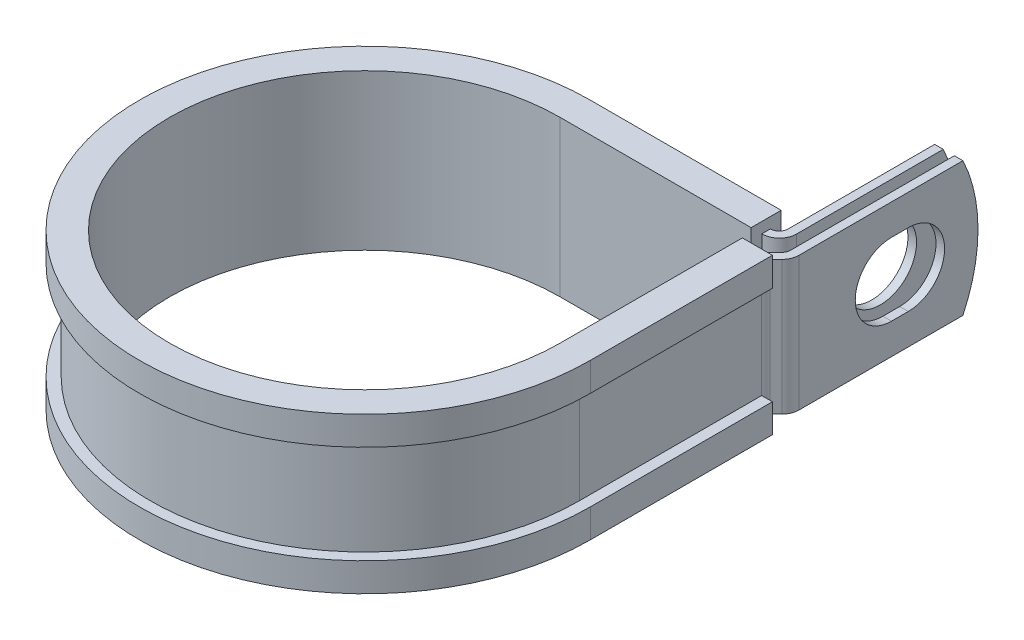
ISO-10303-21;
HEADER;
FILE_DESCRIPTION(('STEP AP214'),'2;1');
FILE_NAME('part.step','',(''),(''),'','','');
FILE_SCHEMA(('AUTOMOTIVE_DESIGN { 1 0 10303 214 1 1 1 1 }'));
ENDSEC;
DATA;
#1=APPLICATION_CONTEXT('core data for automotive mechanical design processes');
#2=APPLICATION_PROTOCOL_DEFINITION('international standard','automotive_design',2000,#1);
#3=PRODUCT_CONTEXT('',#1,'mechanical');
#4=PRODUCT('Part','Part','',(#3));
#5=PRODUCT_RELATED_PRODUCT_CATEGORY('part','',(#4));
#6=PRODUCT_DEFINITION_FORMATION('','',#4);
#7=PRODUCT_DEFINITION_CONTEXT('part definition',#1,'design');
#8=PRODUCT_DEFINITION('design','',#6,#7);
#9=PRODUCT_DEFINITION_SHAPE('','',#8);
#10=(LENGTH_UNIT() NAMED_UNIT(*) SI_UNIT(.MILLI.,.METRE.));
#11=(NAMED_UNIT(*) PLANE_ANGLE_UNIT() SI_UNIT($,.RADIAN.));
#12=(NAMED_UNIT(*) SI_UNIT($,.STERADIAN.) SOLID_ANGLE_UNIT());
#13=UNCERTAINTY_MEASURE_WITH_UNIT(LENGTH_MEASURE(1.E-05),#10,'distance_accuracy_value','');
#14=(GEOMETRIC_REPRESENTATION_CONTEXT(3) GLOBAL_UNCERTAINTY_ASSIGNED_CONTEXT((#13)) GLOBAL_UNIT_ASSIGNED_CONTEXT((#10,
#11,#12)) REPRESENTATION_CONTEXT('',''));
#15=CARTESIAN_POINT('',(0.,0.,0.));
#16=DIRECTION('',(0.,0.,1.));
#17=DIRECTION('',(1.,0.,0.));
#18=AXIS2_PLACEMENT_3D('',#15,#16,#17);
#19=CARTESIAN_POINT('',(29.9771698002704,-9.525,-29.2989));
#20=DIRECTION('',(0.,1.,0.));
#21=DIRECTION('',(1.,0.,0.));
#22=AXIS2_PLACEMENT_3D('',#19,#20,#21);
#23=PLANE('',#22);
#24=DIRECTION('',(0.,0.,-1.));
#25=VECTOR('',#24,1.);
#26=CARTESIAN_POINT('',(27.1323698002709,-9.525,-29.2989));
#27=LINE('',#26,#25);
#28=CARTESIAN_POINT('',(27.1323698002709,-9.525,-29.2989));
#29=VERTEX_POINT('',#28);
#30=CARTESIAN_POINT('',(27.1323698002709,-9.525,-30.5181));
#31=VERTEX_POINT('',#30);
#32=EDGE_CURVE('E524',#29,#31,#27,.T.);
#33=ORIENTED_EDGE('',*,*,#32,.T.);
#34=DIRECTION('',(-1.,0.,0.));
#35=VECTOR('',#34,1.);
#36=CARTESIAN_POINT('',(0.,-9.525,-30.5181));
#37=LINE('',#36,#35);
#38=CARTESIAN_POINT('',(27.1831698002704,-9.525,-30.5181));
#39=VERTEX_POINT('',#38);
#40=EDGE_CURVE('E411',#39,#31,#37,.T.);
#41=ORIENTED_EDGE('',*,*,#40,.F.);
#42=CARTESIAN_POINT('',(27.1831698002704,-9.525,-31.7373));
#43=DIRECTION('',(0.,1.,0.));
#44=DIRECTION('',(1.,0.,0.));
#45=AXIS2_PLACEMENT_3D('',#42,#43,#44);
#46=CIRCLE('',#45,1.2192);
#47=CARTESIAN_POINT('',(28.4023698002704,-9.525,-31.7373));
#48=VERTEX_POINT('',#47);
#49=EDGE_CURVE('E409',#48,#39,#46,.F.);
#50=ORIENTED_EDGE('',*,*,#49,.F.);
#51=DIRECTION('',(0.,0.,1.));
#52=VECTOR('',#51,1.);
#53=CARTESIAN_POINT('',(28.4023698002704,-9.525,-54.737));
#54=LINE('',#53,#52);
#55=CARTESIAN_POINT('',(28.4023698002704,-9.525,-52.5924631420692));
#56=VERTEX_POINT('',#55);
#57=EDGE_CURVE('E407',#56,#48,#54,.T.);
#58=ORIENTED_EDGE('',*,*,#57,.F.);
#59=DIRECTION('',(-1.,0.,0.));
#60=VECTOR('',#59,1.);
#61=CARTESIAN_POINT('',(32.4155698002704,-9.525,-52.5924631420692));
#62=LINE('',#61,#60);
#63=CARTESIAN_POINT('',(29.6215698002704,-9.525,-52.5924631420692));
#64=VERTEX_POINT('',#63);
#65=EDGE_CURVE('E12',#64,#56,#62,.T.);
#66=ORIENTED_EDGE('',*,*,#65,.F.);
#67=DIRECTION('',(0.,0.,1.));
#68=VECTOR('',#67,1.);
#69=CARTESIAN_POINT('',(29.6215698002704,-9.525,-54.737));
#70=LINE('',#69,#68);
#71=CARTESIAN_POINT('',(29.6215698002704,-9.525,-31.7373));
#72=VERTEX_POINT('',#71);
#73=EDGE_CURVE('E405',#64,#72,#70,.T.);
#74=ORIENTED_EDGE('',*,*,#73,.T.);
#75=CARTESIAN_POINT('',(27.1831698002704,-9.525,-31.7373));
#76=DIRECTION('',(0.,-1.,0.));
#77=DIRECTION('',(0.,0.,1.));
#78=AXIS2_PLACEMENT_3D('',#75,#76,#77);
#79=CIRCLE('',#78,2.4384);
#80=CARTESIAN_POINT('',(27.1831698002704,-9.525,-29.2989));
#81=VERTEX_POINT('',#80);
#82=EDGE_CURVE('E402',#72,#81,#79,.T.);
#83=ORIENTED_EDGE('',*,*,#82,.T.);
#84=DIRECTION('',(-1.,0.,0.));
#85=VECTOR('',#84,1.);
#86=CARTESIAN_POINT('',(0.,-9.525,-29.2989));
#87=LINE('',#86,#85);
#88=EDGE_CURVE('E399',#81,#29,#87,.T.);
#89=ORIENTED_EDGE('',*,*,#88,.T.);
#90=EDGE_LOOP('',(#33,#41,#50,#58,#66,#74,#83,#89));
#91=FACE_BOUND('',#90,.T.);
#92=ADVANCED_FACE('F55',(#91),#23,.F.);
#93=CARTESIAN_POINT('',(29.9771698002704,9.525,-29.2989));
#94=DIRECTION('',(0.,1.,0.));
#95=DIRECTION('',(1.,0.,0.));
#96=AXIS2_PLACEMENT_3D('',#93,#94,#95);
#97=PLANE('',#96);
#98=DIRECTION('',(-1.,0.,0.));
#99=VECTOR('',#98,1.);
#100=CARTESIAN_POINT('',(0.,9.525,-30.5181));
#101=LINE('',#100,#99);
#102=CARTESIAN_POINT('',(27.1831698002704,9.525,-30.5181));
#103=VERTEX_POINT('',#102);
#104=CARTESIAN_POINT('',(27.1323698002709,9.525,-30.5181));
#105=VERTEX_POINT('',#104);
#106=EDGE_CURVE('E369',#103,#105,#101,.T.);
#107=ORIENTED_EDGE('',*,*,#106,.T.);
#108=DIRECTION('',(0.,0.,1.));
#109=VECTOR('',#108,1.);
#110=CARTESIAN_POINT('',(27.1323698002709,9.525,-30.5181));
#111=LINE('',#110,#109);
#112=CARTESIAN_POINT('',(27.1323698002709,9.525,-29.2989));
#113=VERTEX_POINT('',#112);
#114=EDGE_CURVE('E518',#105,#113,#111,.T.);
#115=ORIENTED_EDGE('',*,*,#114,.T.);
#116=DIRECTION('',(-1.,0.,0.));
#117=VECTOR('',#116,1.);
#118=CARTESIAN_POINT('',(0.,9.525,-29.2989));
#119=LINE('',#118,#117);
#120=CARTESIAN_POINT('',(27.1831698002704,9.525,-29.2989));
#121=VERTEX_POINT('',#120);
#122=EDGE_CURVE('E626',#121,#113,#119,.T.);
#123=ORIENTED_EDGE('',*,*,#122,.F.);
#124=CARTESIAN_POINT('',(27.1831698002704,9.525,-31.7373));
#125=DIRECTION('',(0.,-1.,0.));
#126=DIRECTION('',(0.,0.,1.));
#127=AXIS2_PLACEMENT_3D('',#124,#125,#126);
#128=CIRCLE('',#127,2.4384);
#129=CARTESIAN_POINT('',(29.6215698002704,9.525,-31.7373));
#130=VERTEX_POINT('',#129);
#131=EDGE_CURVE('E371',#130,#121,#128,.T.);
#132=ORIENTED_EDGE('',*,*,#131,.F.);
#133=DIRECTION('',(0.,0.,1.));
#134=VECTOR('',#133,1.);
#135=CARTESIAN_POINT('',(29.6215698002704,9.525,-54.737));
#136=LINE('',#135,#134);
#137=CARTESIAN_POINT('',(29.6215698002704,9.525,-52.5924631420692));
#138=VERTEX_POINT('',#137);
#139=EDGE_CURVE('E362',#138,#130,#136,.T.);
#140=ORIENTED_EDGE('',*,*,#139,.F.);
#141=DIRECTION('',(-1.,0.,0.));
#142=VECTOR('',#141,1.);
#143=CARTESIAN_POINT('',(32.4155698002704,9.525,-52.5924631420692));
#144=LINE('',#143,#142);
#145=CARTESIAN_POINT('',(28.4023698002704,9.525,-52.5924631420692));
#146=VERTEX_POINT('',#145);
#147=EDGE_CURVE('E63',#138,#146,#144,.T.);
#148=ORIENTED_EDGE('',*,*,#147,.T.);
#149=DIRECTION('',(0.,0.,1.));
#150=VECTOR('',#149,1.);
#151=CARTESIAN_POINT('',(28.4023698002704,9.525,-54.737));
#152=LINE('',#151,#150);
#153=CARTESIAN_POINT('',(28.4023698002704,9.525,-31.7373));
#154=VERTEX_POINT('',#153);
#155=EDGE_CURVE('E359',#146,#154,#152,.T.);
#156=ORIENTED_EDGE('',*,*,#155,.T.);
#157=CARTESIAN_POINT('',(27.1831698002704,9.525,-31.7373));
#158=DIRECTION('',(0.,1.,0.));
#159=DIRECTION('',(1.,0.,0.));
#160=AXIS2_PLACEMENT_3D('',#157,#158,#159);
#161=CIRCLE('',#160,1.2192);
#162=EDGE_CURVE('E367',#154,#103,#161,.F.);
#163=ORIENTED_EDGE('',*,*,#162,.T.);
#164=EDGE_LOOP('',(#107,#115,#123,#132,#140,#148,#156,#163));
#165=FACE_BOUND('',#164,.T.);
#166=ADVANCED_FACE('F358',(#165),#97,.T.);
#167=CARTESIAN_POINT('',(0.,9.525,-29.2989));
#168=DIRECTION('',(0.,0.,1.));
#169=DIRECTION('',(1.,0.,0.));
#170=AXIS2_PLACEMENT_3D('',#167,#168,#169);
#171=PLANE('',#170);
#172=ORIENTED_EDGE('',*,*,#122,.T.);
#173=DIRECTION('',(0.,-1.,0.));
#174=VECTOR('',#173,1.);
#175=CARTESIAN_POINT('',(27.1323698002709,9.525,-29.2989));
#176=LINE('',#175,#174);
#177=EDGE_CURVE('E521',#113,#29,#176,.T.);
#178=ORIENTED_EDGE('',*,*,#177,.T.);
#179=ORIENTED_EDGE('',*,*,#88,.F.);
#180=DIRECTION('',(0.,-1.,0.));
#181=VECTOR('',#180,1.);
#182=CARTESIAN_POINT('',(27.1831698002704,9.525,-29.2989));
#183=LINE('',#182,#181);
#184=EDGE_CURVE('E345',#121,#81,#183,.T.);
#185=ORIENTED_EDGE('',*,*,#184,.F.);
#186=EDGE_LOOP('',(#172,#178,#179,#185));
#187=FACE_BOUND('',#186,.T.);
#188=ADVANCED_FACE('F636',(#187),#171,.T.);
#189=CARTESIAN_POINT('',(32.4155698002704,9.525,-29.2989));
#190=DIRECTION('',(-1.,0.,0.));
#191=DIRECTION('',(0.,0.,1.));
#192=AXIS2_PLACEMENT_3D('',#189,#190,#191);
#193=PLANE('',#192);
#194=CARTESIAN_POINT('',(32.4155698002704,0.,-44.8309999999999));
#195=DIRECTION('',(1.,0.,0.));
#196=DIRECTION('',(0.,0.,-1.));
#197=AXIS2_PLACEMENT_3D('',#194,#195,#196);
#198=CIRCLE('',#197,5.1562);
#199=CARTESIAN_POINT('',(32.4155698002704,-5.1562,-44.8310000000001));
#200=VERTEX_POINT('',#199);
#201=CARTESIAN_POINT('',(32.4155698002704,5.1562,-44.8310000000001));
#202=VERTEX_POINT('',#201);
#203=EDGE_CURVE('E581',#200,#202,#198,.T.);
#204=ORIENTED_EDGE('',*,*,#203,.F.);
#205=DIRECTION('',(0.,0.,-1.));
#206=VECTOR('',#205,1.);
#207=CARTESIAN_POINT('',(32.4155698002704,-5.1562,-42.4433999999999));
#208=LINE('',#207,#206);
#209=CARTESIAN_POINT('',(32.4155698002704,-5.1562,-42.4433999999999));
#210=VERTEX_POINT('',#209);
#211=EDGE_CURVE('E584',#210,#200,#208,.T.);
#212=ORIENTED_EDGE('',*,*,#211,.F.);
#213=CARTESIAN_POINT('',(32.4155698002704,0.,-42.4433999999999));
#214=DIRECTION('',(1.,0.,0.));
#215=DIRECTION('',(0.,0.,-1.));
#216=AXIS2_PLACEMENT_3D('',#213,#214,#215);
#217=CIRCLE('',#216,5.1562);
#218=CARTESIAN_POINT('',(32.4155698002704,5.1562,-42.4433999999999));
#219=VERTEX_POINT('',#218);
#220=EDGE_CURVE('E577',#219,#210,#217,.T.);
#221=ORIENTED_EDGE('',*,*,#220,.F.);
#222=DIRECTION('',(0.,0.,1.));
#223=VECTOR('',#222,1.);
#224=CARTESIAN_POINT('',(32.4155698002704,5.1562,-42.4433999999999));
#225=LINE('',#224,#223);
#226=EDGE_CURVE('E578',#202,#219,#225,.T.);
#227=ORIENTED_EDGE('',*,*,#226,.F.);
#228=EDGE_LOOP('',(#204,#212,#221,#227));
#229=FACE_BOUND('',#228,.T.);
#230=DIRECTION('',(0.,0.,-1.));
#231=VECTOR('',#230,1.);
#232=CARTESIAN_POINT('',(32.4155698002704,-9.525,-29.2989));
#233=LINE('',#232,#231);
#234=CARTESIAN_POINT('',(32.4155698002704,-9.525,-29.2989));
#235=VERTEX_POINT('',#234);
#236=CARTESIAN_POINT('',(32.4155698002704,-9.525,-52.5924631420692));
#237=VERTEX_POINT('',#236);
#238=EDGE_CURVE('E383',#235,#237,#233,.T.);
#239=ORIENTED_EDGE('',*,*,#238,.T.);
#240=CARTESIAN_POINT('',(32.4155698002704,0.,-32.512));
#241=DIRECTION('',(-1.,0.,0.));
#242=DIRECTION('',(0.,0.,1.));
#243=AXIS2_PLACEMENT_3D('',#240,#241,#242);
#244=CIRCLE('',#243,22.225);
#245=CARTESIAN_POINT('',(32.4155698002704,9.525,-52.5924631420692));
#246=VERTEX_POINT('',#245);
#247=EDGE_CURVE('E569',#246,#237,#244,.T.);
#248=ORIENTED_EDGE('',*,*,#247,.F.);
#249=DIRECTION('',(0.,0.,-1.));
#250=VECTOR('',#249,1.);
#251=CARTESIAN_POINT('',(32.4155698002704,9.525,-29.2989));
#252=LINE('',#251,#250);
#253=CARTESIAN_POINT('',(32.4155698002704,9.525,-29.2989));
#254=VERTEX_POINT('',#253);
#255=EDGE_CURVE('E420',#254,#246,#252,.T.);
#256=ORIENTED_EDGE('',*,*,#255,.F.);
#257=DIRECTION('',(0.,-1.,0.));
#258=VECTOR('',#257,1.);
#259=CARTESIAN_POINT('',(32.4155698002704,9.525,-29.2989));
#260=LINE('',#259,#258);
#261=EDGE_CURVE('E382',#254,#235,#260,.T.);
#262=ORIENTED_EDGE('',*,*,#261,.T.);
#263=EDGE_LOOP('',(#239,#248,#256,#262));
#264=FACE_BOUND('',#263,.T.);
#265=ADVANCED_FACE('F57',(#229,#264),#193,.F.);
#266=CARTESIAN_POINT('',(31.1963698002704,9.525,-29.2989));
#267=DIRECTION('',(-1.,0.,0.));
#268=DIRECTION('',(0.,0.,1.));
#269=AXIS2_PLACEMENT_3D('',#266,#267,#268);
#270=PLANE('',#269);
#271=DIRECTION('',(0.,0.,-1.));
#272=VECTOR('',#271,1.);
#273=CARTESIAN_POINT('',(31.1963698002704,-5.1562,-42.4433999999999));
#274=LINE('',#273,#272);
#275=CARTESIAN_POINT('',(31.1963698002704,-5.1562,-42.4433999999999));
#276=VERTEX_POINT('',#275);
#277=CARTESIAN_POINT('',(31.1963698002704,-5.1562,-44.8310000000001));
#278=VERTEX_POINT('',#277);
#279=EDGE_CURVE('E580',#276,#278,#274,.T.);
#280=ORIENTED_EDGE('',*,*,#279,.T.);
#281=CARTESIAN_POINT('',(31.1963698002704,0.,-44.8309999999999));
#282=DIRECTION('',(-1.,0.,0.));
#283=DIRECTION('',(0.,0.,1.));
#284=AXIS2_PLACEMENT_3D('',#281,#282,#283);
#285=CIRCLE('',#284,5.1562);
#286=CARTESIAN_POINT('',(31.1963698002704,5.1562,-44.8310000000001));
#287=VERTEX_POINT('',#286);
#288=EDGE_CURVE('E601',#278,#287,#285,.F.);
#289=ORIENTED_EDGE('',*,*,#288,.T.);
#290=DIRECTION('',(0.,0.,1.));
#291=VECTOR('',#290,1.);
#292=CARTESIAN_POINT('',(31.1963698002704,5.1562,-42.4433999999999));
#293=LINE('',#292,#291);
#294=CARTESIAN_POINT('',(31.1963698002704,5.1562,-42.4433999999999));
#295=VERTEX_POINT('',#294);
#296=EDGE_CURVE('E597',#287,#295,#293,.T.);
#297=ORIENTED_EDGE('',*,*,#296,.T.);
#298=CARTESIAN_POINT('',(31.1963698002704,0.,-42.4433999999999));
#299=DIRECTION('',(-1.,0.,0.));
#300=DIRECTION('',(0.,0.,1.));
#301=AXIS2_PLACEMENT_3D('',#298,#299,#300);
#302=CIRCLE('',#301,5.1562);
#303=EDGE_CURVE('E592',#295,#276,#302,.F.);
#304=ORIENTED_EDGE('',*,*,#303,.T.);
#305=EDGE_LOOP('',(#280,#289,#297,#304));
#306=FACE_BOUND('',#305,.T.);
#307=CARTESIAN_POINT('',(31.1963698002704,0.,-32.512));
#308=DIRECTION('',(-1.,0.,0.));
#309=DIRECTION('',(0.,0.,1.));
#310=AXIS2_PLACEMENT_3D('',#307,#308,#309);
#311=CIRCLE('',#310,22.225);
#312=CARTESIAN_POINT('',(31.1963698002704,9.525,-52.5924631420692));
#313=VERTEX_POINT('',#312);
#314=CARTESIAN_POINT('',(31.1963698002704,-9.525,-52.5924631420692));
#315=VERTEX_POINT('',#314);
#316=EDGE_CURVE('E77',#313,#315,#311,.T.);
#317=ORIENTED_EDGE('',*,*,#316,.T.);
#318=DIRECTION('',(0.,0.,-1.));
#319=VECTOR('',#318,1.);
#320=CARTESIAN_POINT('',(31.1963698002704,-9.525,-29.2989));
#321=LINE('',#320,#319);
#322=CARTESIAN_POINT('',(31.1963698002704,-9.525,-29.2989));
#323=VERTEX_POINT('',#322);
#324=EDGE_CURVE('E386',#323,#315,#321,.T.);
#325=ORIENTED_EDGE('',*,*,#324,.F.);
#326=DIRECTION('',(0.,-1.,0.));
#327=VECTOR('',#326,1.);
#328=CARTESIAN_POINT('',(31.1963698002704,9.525,-29.2989));
#329=LINE('',#328,#327);
#330=CARTESIAN_POINT('',(31.1963698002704,9.525,-29.2989));
#331=VERTEX_POINT('',#330);
#332=EDGE_CURVE('E353',#331,#323,#329,.T.);
#333=ORIENTED_EDGE('',*,*,#332,.F.);
#334=DIRECTION('',(0.,0.,-1.));
#335=VECTOR('',#334,1.);
#336=CARTESIAN_POINT('',(31.1963698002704,9.525,-29.2989));
#337=LINE('',#336,#335);
#338=EDGE_CURVE('E616',#331,#313,#337,.T.);
#339=ORIENTED_EDGE('',*,*,#338,.T.);
#340=EDGE_LOOP('',(#317,#325,#333,#339));
#341=FACE_BOUND('',#340,.T.);
#342=ADVANCED_FACE('F690',(#306,#341),#270,.T.);
#343=CARTESIAN_POINT('',(29.6215698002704,9.525,-54.737));
#344=DIRECTION('',(1.,0.,0.));
#345=DIRECTION('',(0.,0.,-1.));
#346=AXIS2_PLACEMENT_3D('',#343,#344,#345);
#347=PLANE('',#346);
#348=CARTESIAN_POINT('',(29.6215698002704,0.,-43.6372));
#349=DIRECTION('',(1.,0.,0.));
#350=DIRECTION('',(0.,0.,-1.));
#351=AXIS2_PLACEMENT_3D('',#348,#349,#350);
#352=CIRCLE('',#351,5.1562);
#353=CARTESIAN_POINT('',(29.6215698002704,0.,-48.7934));
#354=VERTEX_POINT('',#353);
#355=EDGE_CURVE('E387',#354,#354,#352,.F.);
#356=ORIENTED_EDGE('',*,*,#355,.T.);
#357=EDGE_LOOP('',(#356));
#358=FACE_BOUND('',#357,.T.);
#359=ORIENTED_EDGE('',*,*,#73,.F.);
#360=CARTESIAN_POINT('',(29.6215698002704,0.,-32.512));
#361=DIRECTION('',(1.,0.,0.));
#362=DIRECTION('',(0.,0.,-1.));
#363=AXIS2_PLACEMENT_3D('',#360,#361,#362);
#364=CIRCLE('',#363,22.225);
#365=EDGE_CURVE('E574',#64,#138,#364,.T.);
#366=ORIENTED_EDGE('',*,*,#365,.T.);
#367=ORIENTED_EDGE('',*,*,#139,.T.);
#368=DIRECTION('',(0.,-1.,0.));
#369=VECTOR('',#368,1.);
#370=CARTESIAN_POINT('',(29.6215698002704,9.525,-31.7373));
#371=LINE('',#370,#369);
#372=EDGE_CURVE('E342',#130,#72,#371,.T.);
#373=ORIENTED_EDGE('',*,*,#372,.T.);
#374=EDGE_LOOP('',(#359,#366,#367,#373));
#375=FACE_BOUND('',#374,.T.);
#376=ADVANCED_FACE('F642',(#358,#375),#347,.T.);
#377=CARTESIAN_POINT('',(28.4023698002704,9.525,-54.737));
#378=DIRECTION('',(1.,0.,0.));
#379=DIRECTION('',(0.,0.,-1.));
#380=AXIS2_PLACEMENT_3D('',#377,#378,#379);
#381=PLANE('',#380);
#382=CARTESIAN_POINT('',(28.4023698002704,0.,-43.6372));
#383=DIRECTION('',(-1.,0.,0.));
#384=DIRECTION('',(0.,0.,1.));
#385=AXIS2_PLACEMENT_3D('',#382,#383,#384);
#386=CIRCLE('',#385,5.1562);
#387=CARTESIAN_POINT('',(28.4023698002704,0.,-38.481));
#388=VERTEX_POINT('',#387);
#389=EDGE_CURVE('E609',#388,#388,#386,.T.);
#390=ORIENTED_EDGE('',*,*,#389,.F.);
#391=EDGE_LOOP('',(#390));
#392=FACE_BOUND('',#391,.T.);
#393=CARTESIAN_POINT('',(28.4023698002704,0.,-32.512));
#394=DIRECTION('',(-1.,0.,0.));
#395=DIRECTION('',(0.,0.,1.));
#396=AXIS2_PLACEMENT_3D('',#393,#394,#395);
#397=CIRCLE('',#396,22.225);
#398=EDGE_CURVE('E69',#146,#56,#397,.T.);
#399=ORIENTED_EDGE('',*,*,#398,.T.);
#400=ORIENTED_EDGE('',*,*,#57,.T.);
#401=DIRECTION('',(0.,-1.,0.));
#402=VECTOR('',#401,1.);
#403=CARTESIAN_POINT('',(28.4023698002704,9.525,-31.7373));
#404=LINE('',#403,#402);
#405=EDGE_CURVE('E339',#154,#48,#404,.T.);
#406=ORIENTED_EDGE('',*,*,#405,.F.);
#407=ORIENTED_EDGE('',*,*,#155,.F.);
#408=EDGE_LOOP('',(#399,#400,#406,#407));
#409=FACE_BOUND('',#408,.T.);
#410=ADVANCED_FACE('F365',(#392,#409),#381,.F.);
#411=CARTESIAN_POINT('',(31.7373,-9.525,-25.8864026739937));
#412=DIRECTION('',(0.,1.,0.));
#413=DIRECTION('',(1.,0.,0.));
#414=AXIS2_PLACEMENT_3D('',#411,#412,#413);
#415=CIRCLE('',#414,1.2192);
#416=CARTESIAN_POINT('',(30.5181,-9.525,-25.8864026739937));
#417=VERTEX_POINT('',#416);
#418=CARTESIAN_POINT('',(30.8751954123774,-9.525,-26.7485072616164));
#419=VERTEX_POINT('',#418);
#420=EDGE_CURVE('E414',#417,#419,#415,.F.);
#421=ORIENTED_EDGE('',*,*,#420,.F.);
#422=DIRECTION('',(1.,0.,0.));
#423=VECTOR('',#422,1.);
#424=CARTESIAN_POINT('',(29.2989,-9.525,-25.8864026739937));
#425=LINE('',#424,#423);
#426=CARTESIAN_POINT('',(29.2989,-9.525,-25.8864026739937));
#427=VERTEX_POINT('',#426);
#428=EDGE_CURVE('E452',#427,#417,#425,.T.);
#429=ORIENTED_EDGE('',*,*,#428,.F.);
#430=CARTESIAN_POINT('',(31.7373,-9.525,-25.8864026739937));
#431=DIRECTION('',(0.,-1.,0.));
#432=DIRECTION('',(0.,0.,1.));
#433=AXIS2_PLACEMENT_3D('',#430,#431,#432);
#434=CIRCLE('',#433,2.4384);
#435=CARTESIAN_POINT('',(30.0130908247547,-9.525,-27.610611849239));
#436=VERTEX_POINT('',#435);
#437=EDGE_CURVE('E396',#427,#436,#434,.T.);
#438=ORIENTED_EDGE('',*,*,#437,.T.);
#439=DIRECTION('',(0.707106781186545,0.,-0.70710678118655));
#440=VECTOR('',#439,1.);
#441=CARTESIAN_POINT('',(30.0130908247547,-9.525,-27.610611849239));
#442=LINE('',#441,#440);
#443=CARTESIAN_POINT('',(30.8392743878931,-9.525,-28.4367954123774));
#444=VERTEX_POINT('',#443);
#445=EDGE_CURVE('E393',#436,#444,#442,.T.);
#446=ORIENTED_EDGE('',*,*,#445,.T.);
#447=CARTESIAN_POINT('',(29.9771698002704,-9.525,-29.2989));
#448=DIRECTION('',(0.,1.,0.));
#449=DIRECTION('',(0.,0.,1.));
#450=AXIS2_PLACEMENT_3D('',#447,#448,#449);
#451=CIRCLE('',#450,1.2192);
#452=EDGE_CURVE('E390',#444,#323,#451,.T.);
#453=ORIENTED_EDGE('',*,*,#452,.T.);
#454=ORIENTED_EDGE('',*,*,#324,.T.);
#455=DIRECTION('',(-1.,0.,0.));
#456=VECTOR('',#455,1.);
#457=CARTESIAN_POINT('',(32.4155698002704,-9.525,-52.5924631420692));
#458=LINE('',#457,#456);
#459=EDGE_CURVE('E567',#237,#315,#458,.T.);
#460=ORIENTED_EDGE('',*,*,#459,.F.);
#461=ORIENTED_EDGE('',*,*,#238,.F.);
#462=CARTESIAN_POINT('',(29.9771698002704,-9.525,-29.2989));
#463=DIRECTION('',(0.,1.,0.));
#464=DIRECTION('',(1.,0.,0.));
#465=AXIS2_PLACEMENT_3D('',#462,#463,#464);
#466=CIRCLE('',#465,2.4384);
#467=CARTESIAN_POINT('',(31.7013789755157,-9.525,-27.5746908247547));
#468=VERTEX_POINT('',#467);
#469=EDGE_CURVE('E418',#468,#235,#466,.T.);
#470=ORIENTED_EDGE('',*,*,#469,.F.);
#471=DIRECTION('',(0.707106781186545,0.,-0.70710678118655));
#472=VECTOR('',#471,1.);
#473=CARTESIAN_POINT('',(30.8751954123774,-9.525,-26.7485072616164));
#474=LINE('',#473,#472);
#475=EDGE_CURVE('E416',#419,#468,#474,.T.);
#476=ORIENTED_EDGE('',*,*,#475,.F.);
#477=EDGE_LOOP('',(#421,#429,#438,#446,#453,#454,#460,#461,#470,#476));
#478=FACE_BOUND('',#477,.T.);
#479=ADVANCED_FACE('F676',(#478),#23,.F.);
#480=DIRECTION('',(-1.,0.,0.));
#481=VECTOR('',#480,1.);
#482=CARTESIAN_POINT('',(30.5181,9.525,-25.8864026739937));
#483=LINE('',#482,#481);
#484=CARTESIAN_POINT('',(30.5181,9.525,-25.8864026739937));
#485=VERTEX_POINT('',#484);
#486=CARTESIAN_POINT('',(29.2989,9.525,-25.8864026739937));
#487=VERTEX_POINT('',#486);
#488=EDGE_CURVE('E441',#485,#487,#483,.T.);
#489=ORIENTED_EDGE('',*,*,#488,.F.);
#490=CARTESIAN_POINT('',(31.7373,9.525,-25.8864026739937));
#491=DIRECTION('',(0.,1.,0.));
#492=DIRECTION('',(1.,0.,0.));
#493=AXIS2_PLACEMENT_3D('',#490,#491,#492);
#494=CIRCLE('',#493,1.2192);
#495=CARTESIAN_POINT('',(30.8751954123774,9.525,-26.7485072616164));
#496=VERTEX_POINT('',#495);
#497=EDGE_CURVE('E376',#485,#496,#494,.F.);
#498=ORIENTED_EDGE('',*,*,#497,.T.);
#499=DIRECTION('',(0.707106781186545,0.,-0.70710678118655));
#500=VECTOR('',#499,1.);
#501=CARTESIAN_POINT('',(30.8751954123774,9.525,-26.7485072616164));
#502=LINE('',#501,#500);
#503=CARTESIAN_POINT('',(31.7013789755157,9.525,-27.5746908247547));
#504=VERTEX_POINT('',#503);
#505=EDGE_CURVE('E378',#496,#504,#502,.T.);
#506=ORIENTED_EDGE('',*,*,#505,.T.);
#507=CARTESIAN_POINT('',(29.9771698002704,9.525,-29.2989));
#508=DIRECTION('',(0.,1.,0.));
#509=DIRECTION('',(1.,0.,0.));
#510=AXIS2_PLACEMENT_3D('',#507,#508,#509);
#511=CIRCLE('',#510,2.4384);
#512=EDGE_CURVE('E380',#504,#254,#511,.T.);
#513=ORIENTED_EDGE('',*,*,#512,.T.);
#514=ORIENTED_EDGE('',*,*,#255,.T.);
#515=DIRECTION('',(-1.,0.,0.));
#516=VECTOR('',#515,1.);
#517=CARTESIAN_POINT('',(32.4155698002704,9.525,-52.5924631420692));
#518=LINE('',#517,#516);
#519=EDGE_CURVE('E571',#246,#313,#518,.T.);
#520=ORIENTED_EDGE('',*,*,#519,.T.);
#521=ORIENTED_EDGE('',*,*,#338,.F.);
#522=CARTESIAN_POINT('',(29.9771698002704,9.525,-29.2989));
#523=DIRECTION('',(0.,1.,0.));
#524=DIRECTION('',(0.,0.,1.));
#525=AXIS2_PLACEMENT_3D('',#522,#523,#524);
#526=CIRCLE('',#525,1.2192);
#527=CARTESIAN_POINT('',(30.8392743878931,9.525,-28.4367954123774));
#528=VERTEX_POINT('',#527);
#529=EDGE_CURVE('E619',#528,#331,#526,.T.);
#530=ORIENTED_EDGE('',*,*,#529,.F.);
#531=DIRECTION('',(0.707106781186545,0.,-0.70710678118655));
#532=VECTOR('',#531,1.);
#533=CARTESIAN_POINT('',(30.0130908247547,9.525,-27.610611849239));
#534=LINE('',#533,#532);
#535=CARTESIAN_POINT('',(30.0130908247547,9.525,-27.610611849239));
#536=VERTEX_POINT('',#535);
#537=EDGE_CURVE('E622',#536,#528,#534,.T.);
#538=ORIENTED_EDGE('',*,*,#537,.F.);
#539=CARTESIAN_POINT('',(31.7373,9.525,-25.8864026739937));
#540=DIRECTION('',(0.,-1.,0.));
#541=DIRECTION('',(0.,0.,1.));
#542=AXIS2_PLACEMENT_3D('',#539,#540,#541);
#543=CIRCLE('',#542,2.4384);
#544=EDGE_CURVE('E451',#487,#536,#543,.T.);
#545=ORIENTED_EDGE('',*,*,#544,.F.);
#546=EDGE_LOOP('',(#489,#498,#506,#513,#514,#520,#521,#530,#538,#545));
#547=FACE_BOUND('',#546,.T.);
#548=ADVANCED_FACE('F448',(#547),#97,.T.);
#549=CARTESIAN_POINT('',(29.9771698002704,9.525,-29.2989));
#550=DIRECTION('',(0.,-1.,0.));
#551=DIRECTION('',(0.,0.,-1.));
#552=AXIS2_PLACEMENT_3D('',#549,#550,#551);
#553=CYLINDRICAL_SURFACE('',#552,1.2192);
#554=ORIENTED_EDGE('',*,*,#452,.F.);
#555=DIRECTION('',(0.,-1.,0.));
#556=VECTOR('',#555,1.);
#557=CARTESIAN_POINT('',(30.8392743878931,9.525,-28.4367954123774));
#558=LINE('',#557,#556);
#559=EDGE_CURVE('E351',#528,#444,#558,.T.);
#560=ORIENTED_EDGE('',*,*,#559,.F.);
#561=ORIENTED_EDGE('',*,*,#529,.T.);
#562=ORIENTED_EDGE('',*,*,#332,.T.);
#563=EDGE_LOOP('',(#554,#560,#561,#562));
#564=FACE_BOUND('',#563,.T.);
#565=ADVANCED_FACE('F686',(#564),#553,.F.);
#566=CARTESIAN_POINT('',(30.0130908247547,9.525,-27.610611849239));
#567=DIRECTION('',(-0.70710678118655,0.,-0.707106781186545));
#568=DIRECTION('',(-0.707106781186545,0.,0.70710678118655));
#569=AXIS2_PLACEMENT_3D('',#566,#567,#568);
#570=PLANE('',#569);
#571=ORIENTED_EDGE('',*,*,#445,.F.);
#572=DIRECTION('',(0.,-1.,0.));
#573=VECTOR('',#572,1.);
#574=CARTESIAN_POINT('',(30.0130908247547,9.525,-27.610611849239));
#575=LINE('',#574,#573);
#576=EDGE_CURVE('E349',#536,#436,#575,.T.);
#577=ORIENTED_EDGE('',*,*,#576,.F.);
#578=ORIENTED_EDGE('',*,*,#537,.T.);
#579=ORIENTED_EDGE('',*,*,#559,.T.);
#580=EDGE_LOOP('',(#571,#577,#578,#579));
#581=FACE_BOUND('',#580,.T.);
#582=ADVANCED_FACE('F681',(#581),#570,.T.);
#583=CARTESIAN_POINT('',(31.7373,9.525,-25.8864026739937));
#584=DIRECTION('',(0.,-1.,0.));
#585=DIRECTION('',(0.,0.,-1.));
#586=AXIS2_PLACEMENT_3D('',#583,#584,#585);
#587=CYLINDRICAL_SURFACE('',#586,2.4384);
#588=ORIENTED_EDGE('',*,*,#437,.F.);
#589=DIRECTION('',(0.,-1.,0.));
#590=VECTOR('',#589,1.);
#591=CARTESIAN_POINT('',(29.2989,9.525,-25.8864026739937));
#592=LINE('',#591,#590);
#593=EDGE_CURVE('E347',#487,#427,#592,.T.);
#594=ORIENTED_EDGE('',*,*,#593,.F.);
#595=ORIENTED_EDGE('',*,*,#544,.T.);
#596=ORIENTED_EDGE('',*,*,#576,.T.);
#597=EDGE_LOOP('',(#588,#594,#595,#596));
#598=FACE_BOUND('',#597,.T.);
#599=ADVANCED_FACE('F678',(#598),#587,.T.);
#600=CARTESIAN_POINT('',(27.1831698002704,9.525,-31.7373));
#601=DIRECTION('',(0.,-1.,0.));
#602=DIRECTION('',(0.,0.,-1.));
#603=AXIS2_PLACEMENT_3D('',#600,#601,#602);
#604=CYLINDRICAL_SURFACE('',#603,2.4384);
#605=ORIENTED_EDGE('',*,*,#82,.F.);
#606=ORIENTED_EDGE('',*,*,#372,.F.);
#607=ORIENTED_EDGE('',*,*,#131,.T.);
#608=ORIENTED_EDGE('',*,*,#184,.T.);
#609=EDGE_LOOP('',(#605,#606,#607,#608));
#610=FACE_BOUND('',#609,.T.);
#611=ADVANCED_FACE('F632',(#610),#604,.T.);
#612=CARTESIAN_POINT('',(27.1831698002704,9.525,-31.7373));
#613=DIRECTION('',(0.,-1.,0.));
#614=DIRECTION('',(0.,0.,-1.));
#615=AXIS2_PLACEMENT_3D('',#612,#613,#614);
#616=CYLINDRICAL_SURFACE('',#615,1.2192);
#617=ORIENTED_EDGE('',*,*,#49,.T.);
#618=DIRECTION('',(0.,-1.,0.));
#619=VECTOR('',#618,1.);
#620=CARTESIAN_POINT('',(27.1831698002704,9.525,-30.5181));
#621=LINE('',#620,#619);
#622=EDGE_CURVE('E330',#103,#39,#621,.T.);
#623=ORIENTED_EDGE('',*,*,#622,.F.);
#624=ORIENTED_EDGE('',*,*,#162,.F.);
#625=ORIENTED_EDGE('',*,*,#405,.T.);
#626=EDGE_LOOP('',(#617,#623,#624,#625));
#627=FACE_BOUND('',#626,.T.);
#628=ADVANCED_FACE('F647',(#627),#616,.F.);
#629=CARTESIAN_POINT('',(0.,9.525,-30.5181));
#630=DIRECTION('',(0.,0.,1.));
#631=DIRECTION('',(1.,0.,0.));
#632=AXIS2_PLACEMENT_3D('',#629,#630,#631);
#633=PLANE('',#632);
#634=DIRECTION('',(0.,-1.,0.));
#635=VECTOR('',#634,1.);
#636=CARTESIAN_POINT('',(0.,9.525,-30.5181));
#637=LINE('',#636,#635);
#638=CARTESIAN_POINT('',(4.28082201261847E-13,6.985,-30.5181));
#639=VERTEX_POINT('',#638);
#640=CARTESIAN_POINT('',(4.28082201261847E-13,-6.985,-30.5181));
#641=VERTEX_POINT('',#640);
#642=EDGE_CURVE('E321',#639,#641,#637,.T.);
#643=ORIENTED_EDGE('',*,*,#642,.F.);
#644=DIRECTION('',(1.,0.,0.));
#645=VECTOR('',#644,1.);
#646=CARTESIAN_POINT('',(4.28082201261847E-13,6.985,-30.5181));
#647=LINE('',#646,#645);
#648=CARTESIAN_POINT('',(27.1323698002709,6.985,-30.5181));
#649=VERTEX_POINT('',#648);
#650=EDGE_CURVE('E564',#639,#649,#647,.T.);
#651=ORIENTED_EDGE('',*,*,#650,.T.);
#652=DIRECTION('',(0.,1.,0.));
#653=VECTOR('',#652,1.);
#654=CARTESIAN_POINT('',(27.1323698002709,9.525,-30.5181));
#655=LINE('',#654,#653);
#656=EDGE_CURVE('E515',#649,#105,#655,.T.);
#657=ORIENTED_EDGE('',*,*,#656,.T.);
#658=ORIENTED_EDGE('',*,*,#106,.F.);
#659=ORIENTED_EDGE('',*,*,#622,.T.);
#660=ORIENTED_EDGE('',*,*,#40,.T.);
#661=DIRECTION('',(0.,1.,0.));
#662=VECTOR('',#661,1.);
#663=CARTESIAN_POINT('',(27.1323698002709,-9.525,-30.5181));
#664=LINE('',#663,#662);
#665=CARTESIAN_POINT('',(27.1323698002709,-6.985,-30.5181));
#666=VERTEX_POINT('',#665);
#667=EDGE_CURVE('E527',#31,#666,#664,.T.);
#668=ORIENTED_EDGE('',*,*,#667,.T.);
#669=DIRECTION('',(1.,0.,0.));
#670=VECTOR('',#669,1.);
#671=CARTESIAN_POINT('',(4.28082201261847E-13,-6.985,-30.5181));
#672=LINE('',#671,#670);
#673=EDGE_CURVE('E544',#641,#666,#672,.T.);
#674=ORIENTED_EDGE('',*,*,#673,.F.);
#675=EDGE_LOOP('',(#643,#651,#657,#658,#659,#660,#668,#674));
#676=FACE_BOUND('',#675,.T.);
#677=ADVANCED_FACE('F651',(#676),#633,.F.);
#678=CARTESIAN_POINT('',(0.,9.525,0.));
#679=DIRECTION('',(0.,-1.,0.));
#680=DIRECTION('',(0.,0.,-1.));
#681=AXIS2_PLACEMENT_3D('',#678,#679,#680);
#682=CYLINDRICAL_SURFACE('',#681,30.5181);
#683=DIRECTION('',(0.,-1.,0.));
#684=VECTOR('',#683,1.);
#685=CARTESIAN_POINT('',(30.5181,9.525,0.));
#686=LINE('',#685,#684);
#687=CARTESIAN_POINT('',(30.5181,6.985,0.));
#688=VERTEX_POINT('',#687);
#689=CARTESIAN_POINT('',(30.5181,-6.985,0.));
#690=VERTEX_POINT('',#689);
#691=EDGE_CURVE('E319',#688,#690,#686,.T.);
#692=ORIENTED_EDGE('',*,*,#691,.F.);
#693=CARTESIAN_POINT('',(0.,6.985,0.));
#694=DIRECTION('',(0.,-1.,0.));
#695=DIRECTION('',(0.,0.,-1.));
#696=AXIS2_PLACEMENT_3D('',#693,#694,#695);
#697=CIRCLE('',#696,30.5181);
#698=EDGE_CURVE('E513',#688,#639,#697,.T.);
#699=ORIENTED_EDGE('',*,*,#698,.T.);
#700=ORIENTED_EDGE('',*,*,#642,.T.);
#701=CARTESIAN_POINT('',(0.,-6.985,0.));
#702=DIRECTION('',(0.,-1.,0.));
#703=DIRECTION('',(0.,0.,-1.));
#704=AXIS2_PLACEMENT_3D('',#701,#702,#703);
#705=CIRCLE('',#704,30.5181);
#706=EDGE_CURVE('E302',#690,#641,#705,.T.);
#707=ORIENTED_EDGE('',*,*,#706,.F.);
#708=EDGE_LOOP('',(#692,#699,#700,#707));
#709=FACE_BOUND('',#708,.T.);
#710=ADVANCED_FACE('F317',(#709),#682,.T.);
#711=CARTESIAN_POINT('',(30.5181,9.525,0.));
#712=DIRECTION('',(-1.,0.,0.));
#713=DIRECTION('',(0.,0.,1.));
#714=AXIS2_PLACEMENT_3D('',#711,#712,#713);
#715=PLANE('',#714);
#716=DIRECTION('',(0.,-1.,0.));
#717=VECTOR('',#716,1.);
#718=CARTESIAN_POINT('',(30.5181,9.525,-25.8864026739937));
#719=LINE('',#718,#717);
#720=CARTESIAN_POINT('',(30.5181,6.985,-25.8864026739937));
#721=VERTEX_POINT('',#720);
#722=CARTESIAN_POINT('',(30.5181,-6.985,-25.8864026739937));
#723=VERTEX_POINT('',#722);
#724=EDGE_CURVE('E333',#721,#723,#719,.T.);
#725=ORIENTED_EDGE('',*,*,#724,.F.);
#726=DIRECTION('',(0.,0.,-1.));
#727=VECTOR('',#726,1.);
#728=CARTESIAN_POINT('',(30.5181,6.985,0.));
#729=LINE('',#728,#727);
#730=EDGE_CURVE('E327',#688,#721,#729,.T.);
#731=ORIENTED_EDGE('',*,*,#730,.F.);
#732=ORIENTED_EDGE('',*,*,#691,.T.);
#733=DIRECTION('',(0.,0.,-1.));
#734=VECTOR('',#733,1.);
#735=CARTESIAN_POINT('',(30.5181,-6.985,0.));
#736=LINE('',#735,#734);
#737=EDGE_CURVE('E298',#690,#723,#736,.T.);
#738=ORIENTED_EDGE('',*,*,#737,.T.);
#739=EDGE_LOOP('',(#725,#731,#732,#738));
#740=FACE_BOUND('',#739,.T.);
#741=ADVANCED_FACE('F326',(#740),#715,.F.);
#742=CARTESIAN_POINT('',(31.7373,9.525,-25.8864026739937));
#743=DIRECTION('',(0.,-1.,0.));
#744=DIRECTION('',(0.,0.,-1.));
#745=AXIS2_PLACEMENT_3D('',#742,#743,#744);
#746=CYLINDRICAL_SURFACE('',#745,1.2192);
#747=ORIENTED_EDGE('',*,*,#420,.T.);
#748=DIRECTION('',(0.,-1.,0.));
#749=VECTOR('',#748,1.);
#750=CARTESIAN_POINT('',(30.8751954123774,9.525,-26.7485072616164));
#751=LINE('',#750,#749);
#752=EDGE_CURVE('E425',#496,#419,#751,.T.);
#753=ORIENTED_EDGE('',*,*,#752,.F.);
#754=ORIENTED_EDGE('',*,*,#497,.F.);
#755=EDGE_CURVE('E328',#485,#721,#719,.T.);
#756=ORIENTED_EDGE('',*,*,#755,.T.);
#757=ORIENTED_EDGE('',*,*,#724,.T.);
#758=DIRECTION('',(0.,1.,0.));
#759=VECTOR('',#758,1.);
#760=CARTESIAN_POINT('',(30.5181,-9.525,-25.8864026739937));
#761=LINE('',#760,#759);
#762=EDGE_CURVE('E434',#417,#723,#761,.T.);
#763=ORIENTED_EDGE('',*,*,#762,.F.);
#764=EDGE_LOOP('',(#747,#753,#754,#756,#757,#763));
#765=FACE_BOUND('',#764,.T.);
#766=ADVANCED_FACE('F433',(#765),#746,.F.);
#767=CARTESIAN_POINT('',(30.8751954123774,9.525,-26.7485072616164));
#768=DIRECTION('',(-0.70710678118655,0.,-0.707106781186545));
#769=DIRECTION('',(-0.707106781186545,0.,0.70710678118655));
#770=AXIS2_PLACEMENT_3D('',#767,#768,#769);
#771=PLANE('',#770);
#772=ORIENTED_EDGE('',*,*,#475,.T.);
#773=DIRECTION('',(0.,-1.,0.));
#774=VECTOR('',#773,1.);
#775=CARTESIAN_POINT('',(31.7013789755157,9.525,-27.5746908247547));
#776=LINE('',#775,#774);
#777=EDGE_CURVE('E423',#504,#468,#776,.T.);
#778=ORIENTED_EDGE('',*,*,#777,.F.);
#779=ORIENTED_EDGE('',*,*,#505,.F.);
#780=ORIENTED_EDGE('',*,*,#752,.T.);
#781=EDGE_LOOP('',(#772,#778,#779,#780));
#782=FACE_BOUND('',#781,.T.);
#783=ADVANCED_FACE('F702',(#782),#771,.F.);
#784=CARTESIAN_POINT('',(29.9771698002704,9.525,-29.2989));
#785=DIRECTION('',(0.,-1.,0.));
#786=DIRECTION('',(0.,0.,-1.));
#787=AXIS2_PLACEMENT_3D('',#784,#785,#786);
#788=CYLINDRICAL_SURFACE('',#787,2.4384);
#789=ORIENTED_EDGE('',*,*,#469,.T.);
#790=ORIENTED_EDGE('',*,*,#261,.F.);
#791=ORIENTED_EDGE('',*,*,#512,.F.);
#792=ORIENTED_EDGE('',*,*,#777,.T.);
#793=EDGE_LOOP('',(#789,#790,#791,#792));
#794=FACE_BOUND('',#793,.T.);
#795=ADVANCED_FACE('F700',(#794),#788,.T.);
#796=CARTESIAN_POINT('',(44.2055057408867,0.,-43.6372));
#797=DIRECTION('',(-1.,0.,0.));
#798=DIRECTION('',(0.,0.,1.));
#799=AXIS2_PLACEMENT_3D('',#796,#797,#798);
#800=CYLINDRICAL_SURFACE('',#799,5.1562);
#801=ORIENTED_EDGE('',*,*,#389,.T.);
#802=EDGE_LOOP('',(#801));
#803=FACE_BOUND('',#802,.T.);
#804=ORIENTED_EDGE('',*,*,#355,.F.);
#805=EDGE_LOOP('',(#804));
#806=FACE_BOUND('',#805,.T.);
#807=ADVANCED_FACE('F709',(#803,#806),#800,.F.);
#808=CARTESIAN_POINT('',(14.8367978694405,-5.1562,-42.4433999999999));
#809=DIRECTION('',(0.,-1.,0.));
#810=DIRECTION('',(0.,0.,-1.));
#811=AXIS2_PLACEMENT_3D('',#808,#809,#810);
#812=PLANE('',#811);
#813=DIRECTION('',(1.,0.,0.));
#814=VECTOR('',#813,1.);
#815=CARTESIAN_POINT('',(14.8367978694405,-5.1562,-42.4433999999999));
#816=LINE('',#815,#814);
#817=EDGE_CURVE('E595',#276,#210,#816,.T.);
#818=ORIENTED_EDGE('',*,*,#817,.T.);
#819=ORIENTED_EDGE('',*,*,#211,.T.);
#820=DIRECTION('',(1.,0.,0.));
#821=VECTOR('',#820,1.);
#822=CARTESIAN_POINT('',(14.8367978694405,-5.1562,-44.8310000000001));
#823=LINE('',#822,#821);
#824=EDGE_CURVE('E591',#278,#200,#823,.T.);
#825=ORIENTED_EDGE('',*,*,#824,.F.);
#826=ORIENTED_EDGE('',*,*,#279,.F.);
#827=EDGE_LOOP('',(#818,#819,#825,#826));
#828=FACE_BOUND('',#827,.T.);
#829=ADVANCED_FACE('F752',(#828),#812,.F.);
#830=CARTESIAN_POINT('',(14.8367978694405,0.,-44.8309999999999));
#831=DIRECTION('',(1.,0.,0.));
#832=DIRECTION('',(0.,0.,-1.));
#833=AXIS2_PLACEMENT_3D('',#830,#831,#832);
#834=CYLINDRICAL_SURFACE('',#833,5.1562);
#835=ORIENTED_EDGE('',*,*,#824,.T.);
#836=ORIENTED_EDGE('',*,*,#203,.T.);
#837=DIRECTION('',(1.,0.,0.));
#838=VECTOR('',#837,1.);
#839=CARTESIAN_POINT('',(14.8367978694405,5.1562,-44.8310000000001));
#840=LINE('',#839,#838);
#841=EDGE_CURVE('E600',#287,#202,#840,.T.);
#842=ORIENTED_EDGE('',*,*,#841,.F.);
#843=ORIENTED_EDGE('',*,*,#288,.F.);
#844=EDGE_LOOP('',(#835,#836,#842,#843));
#845=FACE_BOUND('',#844,.T.);
#846=ADVANCED_FACE('F756',(#845),#834,.F.);
#847=CARTESIAN_POINT('',(14.8367978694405,5.1562,-42.4433999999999));
#848=DIRECTION('',(0.,1.,0.));
#849=DIRECTION('',(0.,0.,1.));
#850=AXIS2_PLACEMENT_3D('',#847,#848,#849);
#851=PLANE('',#850);
#852=ORIENTED_EDGE('',*,*,#841,.T.);
#853=ORIENTED_EDGE('',*,*,#226,.T.);
#854=DIRECTION('',(1.,0.,0.));
#855=VECTOR('',#854,1.);
#856=CARTESIAN_POINT('',(14.8367978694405,5.1562,-42.4433999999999));
#857=LINE('',#856,#855);
#858=EDGE_CURVE('E596',#295,#219,#857,.T.);
#859=ORIENTED_EDGE('',*,*,#858,.F.);
#860=ORIENTED_EDGE('',*,*,#296,.F.);
#861=EDGE_LOOP('',(#852,#853,#859,#860));
#862=FACE_BOUND('',#861,.T.);
#863=ADVANCED_FACE('F760',(#862),#851,.F.);
#864=CARTESIAN_POINT('',(14.8367978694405,0.,-42.4433999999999));
#865=DIRECTION('',(1.,0.,0.));
#866=DIRECTION('',(0.,0.,-1.));
#867=AXIS2_PLACEMENT_3D('',#864,#865,#866);
#868=CYLINDRICAL_SURFACE('',#867,5.1562);
#869=ORIENTED_EDGE('',*,*,#858,.T.);
#870=ORIENTED_EDGE('',*,*,#220,.T.);
#871=ORIENTED_EDGE('',*,*,#817,.F.);
#872=ORIENTED_EDGE('',*,*,#303,.F.);
#873=EDGE_LOOP('',(#869,#870,#871,#872));
#874=FACE_BOUND('',#873,.T.);
#875=ADVANCED_FACE('F764',(#874),#868,.F.);
#876=CARTESIAN_POINT('',(32.4155698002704,0.,-32.512));
#877=DIRECTION('',(-1.,0.,0.));
#878=DIRECTION('',(0.,0.,1.));
#879=AXIS2_PLACEMENT_3D('',#876,#877,#878);
#880=CYLINDRICAL_SURFACE('',#879,22.225);
#881=ORIENTED_EDGE('',*,*,#365,.F.);
#882=ORIENTED_EDGE('',*,*,#65,.T.);
#883=ORIENTED_EDGE('',*,*,#398,.F.);
#884=ORIENTED_EDGE('',*,*,#147,.F.);
#885=EDGE_LOOP('',(#881,#882,#883,#884));
#886=FACE_BOUND('',#885,.T.);
#887=ADVANCED_FACE('F643',(#886),#880,.T.);
#888=ORIENTED_EDGE('',*,*,#519,.F.);
#889=ORIENTED_EDGE('',*,*,#247,.T.);
#890=ORIENTED_EDGE('',*,*,#459,.T.);
#891=ORIENTED_EDGE('',*,*,#316,.F.);
#892=EDGE_LOOP('',(#888,#889,#890,#891));
#893=FACE_BOUND('',#892,.T.);
#894=ADVANCED_FACE('F691',(#893),#880,.T.);
#895=CARTESIAN_POINT('',(4.4945958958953E-13,11.049,-32.0421));
#896=DIRECTION('',(0.,0.,1.));
#897=DIRECTION('',(1.,0.,0.));
#898=AXIS2_PLACEMENT_3D('',#895,#896,#897);
#899=PLANE('',#898);
#900=DIRECTION('',(0.,-1.,0.));
#901=VECTOR('',#900,1.);
#902=CARTESIAN_POINT('',(4.4945958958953E-13,11.049,-32.0421));
#903=LINE('',#902,#901);
#904=CARTESIAN_POINT('',(4.4945958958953E-13,11.049,-32.0421));
#905=VERTEX_POINT('',#904);
#906=CARTESIAN_POINT('',(4.4945958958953E-13,6.985,-32.0421));
#907=VERTEX_POINT('',#906);
#908=EDGE_CURVE('E323',#905,#907,#903,.T.);
#909=ORIENTED_EDGE('',*,*,#908,.F.);
#910=DIRECTION('',(1.,0.,0.));
#911=VECTOR('',#910,1.);
#912=CARTESIAN_POINT('',(4.4945958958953E-13,11.049,-32.0421));
#913=LINE('',#912,#911);
#914=CARTESIAN_POINT('',(27.1323698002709,11.049,-32.0421));
#915=VERTEX_POINT('',#914);
#916=EDGE_CURVE('E558',#905,#915,#913,.T.);
#917=ORIENTED_EDGE('',*,*,#916,.T.);
#918=DIRECTION('',(0.,-1.,0.));
#919=VECTOR('',#918,1.);
#920=CARTESIAN_POINT('',(27.1323698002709,11.049,-32.0421));
#921=LINE('',#920,#919);
#922=CARTESIAN_POINT('',(27.1323698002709,6.985,-32.0421));
#923=VERTEX_POINT('',#922);
#924=EDGE_CURVE('E540',#915,#923,#921,.T.);
#925=ORIENTED_EDGE('',*,*,#924,.T.);
#926=DIRECTION('',(1.,0.,0.));
#927=VECTOR('',#926,1.);
#928=CARTESIAN_POINT('',(4.4945958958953E-13,6.985,-32.0421));
#929=LINE('',#928,#927);
#930=EDGE_CURVE('E561',#907,#923,#929,.T.);
#931=ORIENTED_EDGE('',*,*,#930,.F.);
#932=EDGE_LOOP('',(#909,#917,#925,#931));
#933=FACE_BOUND('',#932,.T.);
#934=ADVANCED_FACE('F855',(#933),#899,.F.);
#935=CARTESIAN_POINT('',(3.89602902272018E-13,11.049,-27.7749));
#936=DIRECTION('',(0.,0.,-1.));
#937=DIRECTION('',(0.,1.,0.));
#938=AXIS2_PLACEMENT_3D('',#935,#936,#937);
#939=PLANE('',#938);
#940=DIRECTION('',(0.,1.,0.));
#941=VECTOR('',#940,1.);
#942=CARTESIAN_POINT('',(3.89602902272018E-13,11.049,-27.7749));
#943=LINE('',#942,#941);
#944=CARTESIAN_POINT('',(3.89602902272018E-13,-11.049,-27.7749));
#945=VERTEX_POINT('',#944);
#946=CARTESIAN_POINT('',(3.89602902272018E-13,11.049,-27.7749));
#947=VERTEX_POINT('',#946);
#948=EDGE_CURVE('E491',#945,#947,#943,.T.);
#949=ORIENTED_EDGE('',*,*,#948,.F.);
#950=DIRECTION('',(1.,0.,0.));
#951=VECTOR('',#950,1.);
#952=CARTESIAN_POINT('',(3.89602902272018E-13,-11.049,-27.7749));
#953=LINE('',#952,#951);
#954=CARTESIAN_POINT('',(27.1323698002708,-11.049,-27.7749));
#955=VERTEX_POINT('',#954);
#956=EDGE_CURVE('E552',#945,#955,#953,.T.);
#957=ORIENTED_EDGE('',*,*,#956,.T.);
#958=DIRECTION('',(0.,1.,0.));
#959=VECTOR('',#958,1.);
#960=CARTESIAN_POINT('',(27.1323698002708,11.049,-27.7749));
#961=LINE('',#960,#959);
#962=CARTESIAN_POINT('',(27.1323698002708,11.049,-27.7749));
#963=VERTEX_POINT('',#962);
#964=EDGE_CURVE('E536',#955,#963,#961,.T.);
#965=ORIENTED_EDGE('',*,*,#964,.T.);
#966=DIRECTION('',(1.,0.,0.));
#967=VECTOR('',#966,1.);
#968=CARTESIAN_POINT('',(3.89602902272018E-13,11.049,-27.7749));
#969=LINE('',#968,#967);
#970=EDGE_CURVE('E555',#947,#963,#969,.T.);
#971=ORIENTED_EDGE('',*,*,#970,.F.);
#972=EDGE_LOOP('',(#949,#957,#965,#971));
#973=FACE_BOUND('',#972,.T.);
#974=ADVANCED_FACE('F941',(#973),#939,.F.);
#975=CARTESIAN_POINT('',(4.4945958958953E-13,-11.049,-32.0421));
#976=DIRECTION('',(0.,0.,1.));
#977=DIRECTION('',(1.,0.,0.));
#978=AXIS2_PLACEMENT_3D('',#975,#976,#977);
#979=PLANE('',#978);
#980=DIRECTION('',(0.,-1.,0.));
#981=VECTOR('',#980,1.);
#982=CARTESIAN_POINT('',(4.4945958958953E-13,-11.049,-32.0421));
#983=LINE('',#982,#981);
#984=CARTESIAN_POINT('',(4.4945958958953E-13,-6.985,-32.0421));
#985=VERTEX_POINT('',#984);
#986=CARTESIAN_POINT('',(4.4945958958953E-13,-11.049,-32.0421));
#987=VERTEX_POINT('',#986);
#988=EDGE_CURVE('E477',#985,#987,#983,.T.);
#989=ORIENTED_EDGE('',*,*,#988,.F.);
#990=DIRECTION('',(1.,0.,0.));
#991=VECTOR('',#990,1.);
#992=CARTESIAN_POINT('',(4.4945958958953E-13,-6.985,-32.0421));
#993=LINE('',#992,#991);
#994=CARTESIAN_POINT('',(27.1323698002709,-6.985,-32.0421));
#995=VERTEX_POINT('',#994);
#996=EDGE_CURVE('E546',#985,#995,#993,.T.);
#997=ORIENTED_EDGE('',*,*,#996,.T.);
#998=DIRECTION('',(0.,-1.,0.));
#999=VECTOR('',#998,1.);
#1000=CARTESIAN_POINT('',(27.1323698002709,-11.049,-32.0421));
#1001=LINE('',#1000,#999);
#1002=CARTESIAN_POINT('',(27.1323698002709,-11.049,-32.0421));
#1003=VERTEX_POINT('',#1002);
#1004=EDGE_CURVE('E532',#995,#1003,#1001,.T.);
#1005=ORIENTED_EDGE('',*,*,#1004,.T.);
#1006=DIRECTION('',(1.,0.,0.));
#1007=VECTOR('',#1006,1.);
#1008=CARTESIAN_POINT('',(4.4945958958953E-13,-11.049,-32.0421));
#1009=LINE('',#1008,#1007);
#1010=EDGE_CURVE('E549',#987,#1003,#1009,.T.);
#1011=ORIENTED_EDGE('',*,*,#1010,.F.);
#1012=EDGE_LOOP('',(#989,#997,#1005,#1011));
#1013=FACE_BOUND('',#1012,.T.);
#1014=ADVANCED_FACE('F662',(#1013),#979,.F.);
#1015=CARTESIAN_POINT('',(0.,9.525,0.));
#1016=DIRECTION('',(0.,-1.,0.));
#1017=DIRECTION('',(0.,0.,-1.));
#1018=AXIS2_PLACEMENT_3D('',#1015,#1016,#1017);
#1019=CYLINDRICAL_SURFACE('',#1018,32.0421);
#1020=DIRECTION('',(0.,-1.,0.));
#1021=VECTOR('',#1020,1.);
#1022=CARTESIAN_POINT('',(32.0421,11.049,0.));
#1023=LINE('',#1022,#1021);
#1024=CARTESIAN_POINT('',(32.0421,11.049,0.));
#1025=VERTEX_POINT('',#1024);
#1026=CARTESIAN_POINT('',(32.0421,6.985,0.));
#1027=VERTEX_POINT('',#1026);
#1028=EDGE_CURVE('E312',#1025,#1027,#1023,.T.);
#1029=ORIENTED_EDGE('',*,*,#1028,.F.);
#1030=CARTESIAN_POINT('',(0.,11.049,0.));
#1031=DIRECTION('',(0.,-1.,0.));
#1032=DIRECTION('',(0.,0.,-1.));
#1033=AXIS2_PLACEMENT_3D('',#1030,#1031,#1032);
#1034=CIRCLE('',#1033,32.0421);
#1035=EDGE_CURVE('E507',#1025,#905,#1034,.T.);
#1036=ORIENTED_EDGE('',*,*,#1035,.T.);
#1037=ORIENTED_EDGE('',*,*,#908,.T.);
#1038=CARTESIAN_POINT('',(0.,6.985,0.));
#1039=DIRECTION('',(0.,-1.,0.));
#1040=DIRECTION('',(0.,0.,-1.));
#1041=AXIS2_PLACEMENT_3D('',#1038,#1039,#1040);
#1042=CIRCLE('',#1041,32.0421);
#1043=EDGE_CURVE('E510',#1027,#907,#1042,.T.);
#1044=ORIENTED_EDGE('',*,*,#1043,.F.);
#1045=EDGE_LOOP('',(#1029,#1036,#1037,#1044));
#1046=FACE_BOUND('',#1045,.T.);
#1047=ADVANCED_FACE('F961',(#1046),#1019,.T.);
#1048=CARTESIAN_POINT('',(0.,9.525,0.));
#1049=DIRECTION('',(0.,-1.,0.));
#1050=DIRECTION('',(0.,0.,-1.));
#1051=AXIS2_PLACEMENT_3D('',#1048,#1049,#1050);
#1052=CYLINDRICAL_SURFACE('',#1051,27.7749);
#1053=DIRECTION('',(0.,1.,0.));
#1054=VECTOR('',#1053,1.);
#1055=CARTESIAN_POINT('',(27.7749,11.049,0.));
#1056=LINE('',#1055,#1054);
#1057=CARTESIAN_POINT('',(27.7749,-11.049,0.));
#1058=VERTEX_POINT('',#1057);
#1059=CARTESIAN_POINT('',(27.7749,11.049,0.));
#1060=VERTEX_POINT('',#1059);
#1061=EDGE_CURVE('E1124',#1058,#1060,#1056,.T.);
#1062=ORIENTED_EDGE('',*,*,#1061,.F.);
#1063=CARTESIAN_POINT('',(0.,-11.049,0.));
#1064=DIRECTION('',(0.,-1.,0.));
#1065=DIRECTION('',(0.,0.,-1.));
#1066=AXIS2_PLACEMENT_3D('',#1063,#1064,#1065);
#1067=CIRCLE('',#1066,27.7749);
#1068=EDGE_CURVE('E501',#1058,#945,#1067,.T.);
#1069=ORIENTED_EDGE('',*,*,#1068,.T.);
#1070=ORIENTED_EDGE('',*,*,#948,.T.);
#1071=CARTESIAN_POINT('',(0.,11.049,0.));
#1072=DIRECTION('',(0.,-1.,0.));
#1073=DIRECTION('',(0.,0.,-1.));
#1074=AXIS2_PLACEMENT_3D('',#1071,#1072,#1073);
#1075=CIRCLE('',#1074,27.7749);
#1076=EDGE_CURVE('E504',#1060,#947,#1075,.T.);
#1077=ORIENTED_EDGE('',*,*,#1076,.F.);
#1078=EDGE_LOOP('',(#1062,#1069,#1070,#1077));
#1079=FACE_BOUND('',#1078,.T.);
#1080=ADVANCED_FACE('F971',(#1079),#1052,.F.);
#1081=CARTESIAN_POINT('',(0.,9.525,0.));
#1082=DIRECTION('',(0.,-1.,0.));
#1083=DIRECTION('',(0.,0.,-1.));
#1084=AXIS2_PLACEMENT_3D('',#1081,#1082,#1083);
#1085=CYLINDRICAL_SURFACE('',#1084,32.0421);
#1086=DIRECTION('',(0.,-1.,0.));
#1087=VECTOR('',#1086,1.);
#1088=CARTESIAN_POINT('',(32.0421,-11.049,0.));
#1089=LINE('',#1088,#1087);
#1090=CARTESIAN_POINT('',(32.0421,-6.985,0.));
#1091=VERTEX_POINT('',#1090);
#1092=CARTESIAN_POINT('',(32.0421,-11.049,0.));
#1093=VERTEX_POINT('',#1092);
#1094=EDGE_CURVE('E475',#1091,#1093,#1089,.T.);
#1095=ORIENTED_EDGE('',*,*,#1094,.F.);
#1096=CARTESIAN_POINT('',(0.,-6.985,0.));
#1097=DIRECTION('',(0.,-1.,0.));
#1098=DIRECTION('',(0.,0.,-1.));
#1099=AXIS2_PLACEMENT_3D('',#1096,#1097,#1098);
#1100=CIRCLE('',#1099,32.0421);
#1101=EDGE_CURVE('E322',#1091,#985,#1100,.T.);
#1102=ORIENTED_EDGE('',*,*,#1101,.T.);
#1103=ORIENTED_EDGE('',*,*,#988,.T.);
#1104=CARTESIAN_POINT('',(0.,-11.049,0.));
#1105=DIRECTION('',(0.,-1.,0.));
#1106=DIRECTION('',(0.,0.,-1.));
#1107=AXIS2_PLACEMENT_3D('',#1104,#1105,#1106);
#1108=CIRCLE('',#1107,32.0421);
#1109=EDGE_CURVE('E498',#1093,#987,#1108,.T.);
#1110=ORIENTED_EDGE('',*,*,#1109,.F.);
#1111=EDGE_LOOP('',(#1095,#1102,#1103,#1110));
#1112=FACE_BOUND('',#1111,.T.);
#1113=ADVANCED_FACE('F665',(#1112),#1085,.T.);
#1114=CARTESIAN_POINT('',(32.0421,6.985,0.));
#1115=DIRECTION('',(0.,-1.,0.));
#1116=DIRECTION('',(0.,0.,-1.));
#1117=AXIS2_PLACEMENT_3D('',#1114,#1115,#1116);
#1118=PLANE('',#1117);
#1119=DIRECTION('',(-1.,0.,0.));
#1120=VECTOR('',#1119,1.);
#1121=CARTESIAN_POINT('',(32.0421,6.985,-25.8864026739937));
#1122=LINE('',#1121,#1120);
#1123=CARTESIAN_POINT('',(32.0421,6.985,-25.8864026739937));
#1124=VERTEX_POINT('',#1123);
#1125=EDGE_CURVE('E445',#1124,#721,#1122,.T.);
#1126=ORIENTED_EDGE('',*,*,#1125,.F.);
#1127=DIRECTION('',(0.,0.,-1.));
#1128=VECTOR('',#1127,1.);
#1129=CARTESIAN_POINT('',(32.0421,6.985,0.));
#1130=LINE('',#1129,#1128);
#1131=EDGE_CURVE('E478',#1027,#1124,#1130,.T.);
#1132=ORIENTED_EDGE('',*,*,#1131,.F.);
#1133=ORIENTED_EDGE('',*,*,#1043,.T.);
#1134=ORIENTED_EDGE('',*,*,#930,.T.);
#1135=DIRECTION('',(0.,0.,1.));
#1136=VECTOR('',#1135,1.);
#1137=CARTESIAN_POINT('',(27.1323698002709,6.985,-32.0421));
#1138=LINE('',#1137,#1136);
#1139=EDGE_CURVE('E542',#923,#649,#1138,.T.);
#1140=ORIENTED_EDGE('',*,*,#1139,.T.);
#1141=ORIENTED_EDGE('',*,*,#650,.F.);
#1142=ORIENTED_EDGE('',*,*,#698,.F.);
#1143=ORIENTED_EDGE('',*,*,#730,.T.);
#1144=EDGE_LOOP('',(#1126,#1132,#1133,#1134,#1140,#1141,#1142,#1143));
#1145=FACE_BOUND('',#1144,.T.);
#1146=ADVANCED_FACE('F992',(#1145),#1118,.T.);
#1147=CARTESIAN_POINT('',(32.0421,11.049,0.));
#1148=DIRECTION('',(1.,0.,0.));
#1149=DIRECTION('',(0.,0.,-1.));
#1150=AXIS2_PLACEMENT_3D('',#1147,#1148,#1149);
#1151=PLANE('',#1150);
#1152=DIRECTION('',(0.,-1.,0.));
#1153=VECTOR('',#1152,1.);
#1154=CARTESIAN_POINT('',(32.0421,11.049,-25.8864026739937));
#1155=LINE('',#1154,#1153);
#1156=CARTESIAN_POINT('',(32.0421,11.049,-25.8864026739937));
#1157=VERTEX_POINT('',#1156);
#1158=EDGE_CURVE('E472',#1157,#1124,#1155,.T.);
#1159=ORIENTED_EDGE('',*,*,#1158,.F.);
#1160=DIRECTION('',(0.,0.,-1.));
#1161=VECTOR('',#1160,1.);
#1162=CARTESIAN_POINT('',(32.0421,11.049,0.));
#1163=LINE('',#1162,#1161);
#1164=EDGE_CURVE('E480',#1025,#1157,#1163,.T.);
#1165=ORIENTED_EDGE('',*,*,#1164,.F.);
#1166=ORIENTED_EDGE('',*,*,#1028,.T.);
#1167=ORIENTED_EDGE('',*,*,#1131,.T.);
#1168=EDGE_LOOP('',(#1159,#1165,#1166,#1167));
#1169=FACE_BOUND('',#1168,.T.);
#1170=ADVANCED_FACE('F1003',(#1169),#1151,.T.);
#1171=CARTESIAN_POINT('',(32.0421,11.049,0.));
#1172=DIRECTION('',(0.,1.,0.));
#1173=DIRECTION('',(0.,0.,1.));
#1174=AXIS2_PLACEMENT_3D('',#1171,#1172,#1173);
#1175=PLANE('',#1174);
#1176=DIRECTION('',(1.,0.,0.));
#1177=VECTOR('',#1176,1.);
#1178=CARTESIAN_POINT('',(32.0421,11.049,-25.8864026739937));
#1179=LINE('',#1178,#1177);
#1180=CARTESIAN_POINT('',(27.7749,11.049,-25.8864026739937));
#1181=VERTEX_POINT('',#1180);
#1182=EDGE_CURVE('E469',#1181,#1157,#1179,.T.);
#1183=ORIENTED_EDGE('',*,*,#1182,.F.);
#1184=DIRECTION('',(0.,0.,-1.));
#1185=VECTOR('',#1184,1.);
#1186=CARTESIAN_POINT('',(27.7749,11.049,0.));
#1187=LINE('',#1186,#1185);
#1188=EDGE_CURVE('E482',#1060,#1181,#1187,.T.);
#1189=ORIENTED_EDGE('',*,*,#1188,.F.);
#1190=ORIENTED_EDGE('',*,*,#1076,.T.);
#1191=ORIENTED_EDGE('',*,*,#970,.T.);
#1192=DIRECTION('',(0.,0.,-1.));
#1193=VECTOR('',#1192,1.);
#1194=CARTESIAN_POINT('',(27.1323698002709,11.049,-32.0421));
#1195=LINE('',#1194,#1193);
#1196=EDGE_CURVE('E538',#963,#915,#1195,.T.);
#1197=ORIENTED_EDGE('',*,*,#1196,.T.);
#1198=ORIENTED_EDGE('',*,*,#916,.F.);
#1199=ORIENTED_EDGE('',*,*,#1035,.F.);
#1200=ORIENTED_EDGE('',*,*,#1164,.T.);
#1201=EDGE_LOOP('',(#1183,#1189,#1190,#1191,#1197,#1198,#1199,#1200));
#1202=FACE_BOUND('',#1201,.T.);
#1203=ADVANCED_FACE('F1015',(#1202),#1175,.T.);
#1204=CARTESIAN_POINT('',(27.7749,11.049,0.));
#1205=DIRECTION('',(-1.,0.,0.));
#1206=DIRECTION('',(0.,-1.,0.));
#1207=AXIS2_PLACEMENT_3D('',#1204,#1205,#1206);
#1208=PLANE('',#1207);
#1209=DIRECTION('',(0.,1.,0.));
#1210=VECTOR('',#1209,1.);
#1211=CARTESIAN_POINT('',(27.7749,11.049,-25.8864026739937));
#1212=LINE('',#1211,#1210);
#1213=CARTESIAN_POINT('',(27.7749,-11.049,-25.8864026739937));
#1214=VERTEX_POINT('',#1213);
#1215=EDGE_CURVE('E466',#1214,#1181,#1212,.T.);
#1216=ORIENTED_EDGE('',*,*,#1215,.F.);
#1217=DIRECTION('',(0.,0.,-1.));
#1218=VECTOR('',#1217,1.);
#1219=CARTESIAN_POINT('',(27.7749,-11.049,0.));
#1220=LINE('',#1219,#1218);
#1221=EDGE_CURVE('E484',#1058,#1214,#1220,.T.);
#1222=ORIENTED_EDGE('',*,*,#1221,.F.);
#1223=ORIENTED_EDGE('',*,*,#1061,.T.);
#1224=ORIENTED_EDGE('',*,*,#1188,.T.);
#1225=EDGE_LOOP('',(#1216,#1222,#1223,#1224));
#1226=FACE_BOUND('',#1225,.T.);
#1227=ADVANCED_FACE('F1027',(#1226),#1208,.T.);
#1228=CARTESIAN_POINT('',(27.7749,-11.049,0.));
#1229=DIRECTION('',(0.,-1.,0.));
#1230=DIRECTION('',(0.,0.,-1.));
#1231=AXIS2_PLACEMENT_3D('',#1228,#1229,#1230);
#1232=PLANE('',#1231);
#1233=DIRECTION('',(-1.,0.,0.));
#1234=VECTOR('',#1233,1.);
#1235=CARTESIAN_POINT('',(27.7749,-11.049,-25.8864026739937));
#1236=LINE('',#1235,#1234);
#1237=CARTESIAN_POINT('',(32.0421,-11.049,-25.8864026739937));
#1238=VERTEX_POINT('',#1237);
#1239=EDGE_CURVE('E463',#1238,#1214,#1236,.T.);
#1240=ORIENTED_EDGE('',*,*,#1239,.F.);
#1241=DIRECTION('',(0.,0.,-1.));
#1242=VECTOR('',#1241,1.);
#1243=CARTESIAN_POINT('',(32.0421,-11.049,0.));
#1244=LINE('',#1243,#1242);
#1245=EDGE_CURVE('E486',#1093,#1238,#1244,.T.);
#1246=ORIENTED_EDGE('',*,*,#1245,.F.);
#1247=ORIENTED_EDGE('',*,*,#1109,.T.);
#1248=ORIENTED_EDGE('',*,*,#1010,.T.);
#1249=DIRECTION('',(0.,0.,1.));
#1250=VECTOR('',#1249,1.);
#1251=CARTESIAN_POINT('',(27.1323698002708,-11.049,-27.7749));
#1252=LINE('',#1251,#1250);
#1253=EDGE_CURVE('E534',#1003,#955,#1252,.T.);
#1254=ORIENTED_EDGE('',*,*,#1253,.T.);
#1255=ORIENTED_EDGE('',*,*,#956,.F.);
#1256=ORIENTED_EDGE('',*,*,#1068,.F.);
#1257=ORIENTED_EDGE('',*,*,#1221,.T.);
#1258=EDGE_LOOP('',(#1240,#1246,#1247,#1248,#1254,#1255,#1256,#1257));
#1259=FACE_BOUND('',#1258,.T.);
#1260=ADVANCED_FACE('F1039',(#1259),#1232,.T.);
#1261=CARTESIAN_POINT('',(32.0421,-11.049,0.));
#1262=DIRECTION('',(1.,0.,0.));
#1263=DIRECTION('',(0.,0.,-1.));
#1264=AXIS2_PLACEMENT_3D('',#1261,#1262,#1263);
#1265=PLANE('',#1264);
#1266=DIRECTION('',(0.,-1.,0.));
#1267=VECTOR('',#1266,1.);
#1268=CARTESIAN_POINT('',(32.0421,-11.049,-25.8864026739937));
#1269=LINE('',#1268,#1267);
#1270=CARTESIAN_POINT('',(32.0421,-6.985,-25.8864026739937));
#1271=VERTEX_POINT('',#1270);
#1272=EDGE_CURVE('E460',#1271,#1238,#1269,.T.);
#1273=ORIENTED_EDGE('',*,*,#1272,.F.);
#1274=DIRECTION('',(0.,0.,-1.));
#1275=VECTOR('',#1274,1.);
#1276=CARTESIAN_POINT('',(32.0421,-6.985,0.));
#1277=LINE('',#1276,#1275);
#1278=EDGE_CURVE('E311',#1091,#1271,#1277,.T.);
#1279=ORIENTED_EDGE('',*,*,#1278,.F.);
#1280=ORIENTED_EDGE('',*,*,#1094,.T.);
#1281=ORIENTED_EDGE('',*,*,#1245,.T.);
#1282=EDGE_LOOP('',(#1273,#1279,#1280,#1281));
#1283=FACE_BOUND('',#1282,.T.);
#1284=ADVANCED_FACE('F670',(#1283),#1265,.T.);
#1285=CARTESIAN_POINT('',(30.5181,-6.985,0.));
#1286=DIRECTION('',(0.,1.,0.));
#1287=DIRECTION('',(0.,0.,1.));
#1288=AXIS2_PLACEMENT_3D('',#1285,#1286,#1287);
#1289=PLANE('',#1288);
#1290=DIRECTION('',(1.,0.,0.));
#1291=VECTOR('',#1290,1.);
#1292=CARTESIAN_POINT('',(30.5181,-6.985,-25.8864026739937));
#1293=LINE('',#1292,#1291);
#1294=EDGE_CURVE('E305',#723,#1271,#1293,.T.);
#1295=ORIENTED_EDGE('',*,*,#1294,.F.);
#1296=ORIENTED_EDGE('',*,*,#737,.F.);
#1297=ORIENTED_EDGE('',*,*,#706,.T.);
#1298=ORIENTED_EDGE('',*,*,#673,.T.);
#1299=DIRECTION('',(0.,0.,-1.));
#1300=VECTOR('',#1299,1.);
#1301=CARTESIAN_POINT('',(27.1323698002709,-6.985,-30.5181));
#1302=LINE('',#1301,#1300);
#1303=EDGE_CURVE('E530',#666,#995,#1302,.T.);
#1304=ORIENTED_EDGE('',*,*,#1303,.T.);
#1305=ORIENTED_EDGE('',*,*,#996,.F.);
#1306=ORIENTED_EDGE('',*,*,#1101,.F.);
#1307=ORIENTED_EDGE('',*,*,#1278,.T.);
#1308=EDGE_LOOP('',(#1295,#1296,#1297,#1298,#1304,#1305,#1306,#1307));
#1309=FACE_BOUND('',#1308,.T.);
#1310=ADVANCED_FACE('F300',(#1309),#1289,.T.);
#1311=CARTESIAN_POINT('',(27.1323698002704,0.,0.));
#1312=DIRECTION('',(-1.,0.,0.));
#1313=DIRECTION('',(0.,0.,1.));
#1314=AXIS2_PLACEMENT_3D('',#1311,#1312,#1313);
#1315=PLANE('',#1314);
#1316=ORIENTED_EDGE('',*,*,#656,.F.);
#1317=ORIENTED_EDGE('',*,*,#1139,.F.);
#1318=ORIENTED_EDGE('',*,*,#924,.F.);
#1319=ORIENTED_EDGE('',*,*,#1196,.F.);
#1320=ORIENTED_EDGE('',*,*,#964,.F.);
#1321=ORIENTED_EDGE('',*,*,#1253,.F.);
#1322=ORIENTED_EDGE('',*,*,#1004,.F.);
#1323=ORIENTED_EDGE('',*,*,#1303,.F.);
#1324=ORIENTED_EDGE('',*,*,#667,.F.);
#1325=ORIENTED_EDGE('',*,*,#32,.F.);
#1326=ORIENTED_EDGE('',*,*,#177,.F.);
#1327=ORIENTED_EDGE('',*,*,#114,.F.);
#1328=EDGE_LOOP('',(#1316,#1317,#1318,#1319,#1320,#1321,#1322,#1323,#1324,#1325,#1326,#1327));
#1329=FACE_BOUND('',#1328,.T.);
#1330=ADVANCED_FACE('F655',(#1329),#1315,.F.);
#1331=CARTESIAN_POINT('',(0.,0.,-25.8864026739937));
#1332=DIRECTION('',(0.,0.,-1.));
#1333=DIRECTION('',(-1.,0.,0.));
#1334=AXIS2_PLACEMENT_3D('',#1331,#1332,#1333);
#1335=PLANE('',#1334);
#1336=ORIENTED_EDGE('',*,*,#755,.F.);
#1337=ORIENTED_EDGE('',*,*,#488,.T.);
#1338=ORIENTED_EDGE('',*,*,#593,.T.);
#1339=ORIENTED_EDGE('',*,*,#428,.T.);
#1340=ORIENTED_EDGE('',*,*,#762,.T.);
#1341=ORIENTED_EDGE('',*,*,#1294,.T.);
#1342=ORIENTED_EDGE('',*,*,#1272,.T.);
#1343=ORIENTED_EDGE('',*,*,#1239,.T.);
#1344=ORIENTED_EDGE('',*,*,#1215,.T.);
#1345=ORIENTED_EDGE('',*,*,#1182,.T.);
#1346=ORIENTED_EDGE('',*,*,#1158,.T.);
#1347=ORIENTED_EDGE('',*,*,#1125,.T.);
#1348=EDGE_LOOP('',(#1336,#1337,#1338,#1339,#1340,#1341,#1342,#1343,#1344,#1345,#1346,#1347));
#1349=FACE_BOUND('',#1348,.T.);
#1350=ADVANCED_FACE('F440',(#1349),#1335,.T.);
#1351=CLOSED_SHELL('',(#92,#166,#188,#265,#342,#376,#410,#479,#548,#565,#582,#599,#611,#628,
#677,#710,#741,#766,#783,#795,#807,#829,#846,#863,#875,#887,#894,#934,#974,#1014,#1047,#1080,
#1113,#1146,#1170,#1203,#1227,#1260,#1284,#1310,#1330,#1350));
#1352=MANIFOLD_SOLID_BREP('B2',#1351);
#1353=ADVANCED_BREP_SHAPE_REPRESENTATION('',(#18,#1352),#14);
#1354=SHAPE_DEFINITION_REPRESENTATION(#9,#1353);
ENDSEC;
END-ISO-10303-21;
